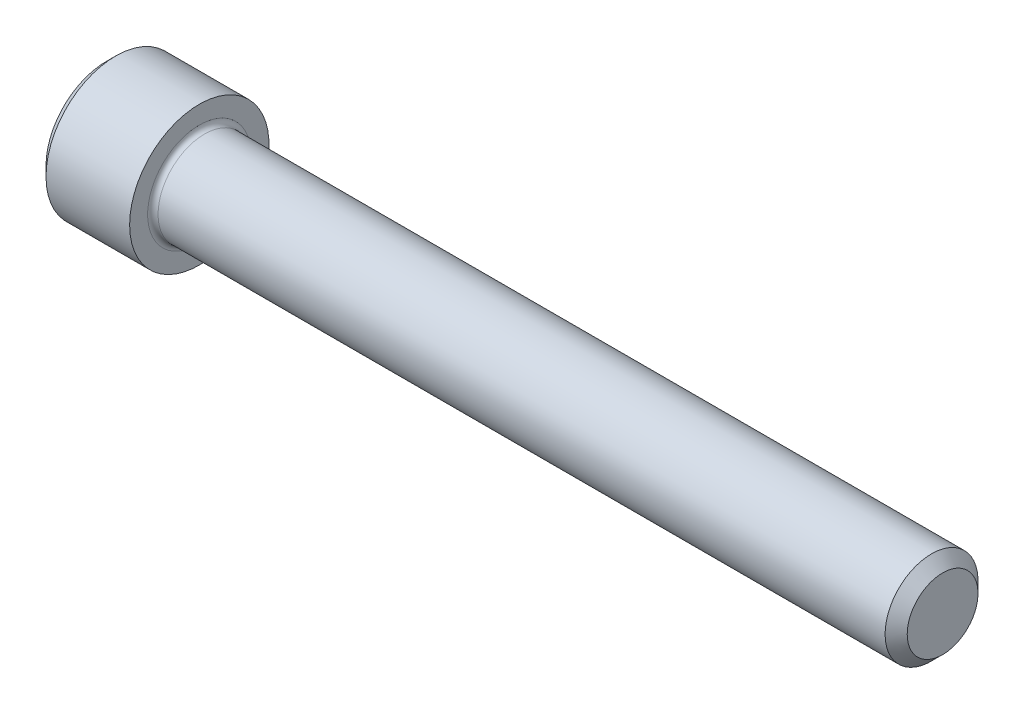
from build123d import *

# Parameters (mm, degrees)
FILLET1_R   = 0.3556
HEX_2_DEPTH = 3.048


with BuildPart() as part:
    # BodySke → Base-Revolve (revolve)
    with BuildSketch(Plane.XY, mode=Mode.PRIVATE) as base_revolve_sk:
        Polygon((0, 0), (0, 4.1275), (0.635, 4.7625), (6.35, 4.7625), (6.35, 3.175), (56.39435, 3.175), (57.15, 2.41935), (57.15, 0), align=None)
    revolve(base_revolve_sk.sketch.rotate(Axis((-31.75, 0, 0), (1, 0, 0)), 90), axis=Axis((-31.75, 0, 0), (1, 0, 0)))

    # Fillet1
    fillet1_edges = [part.edges().sort_by_distance(p)[0] for p in [
        (6.35, 0, -3.175),
    ]]
    fillet(fillet1_edges, radius=FILLET1_R)

    # Sketch2 → Hex-PreBroach (revolve, cut)
    with BuildSketch(Plane.XY, mode=Mode.PRIVATE) as hex_prebroach_sk:
        Polygon((0, 2.38125), (3.048, 2.38125), (4.422815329, 0), (0, 0), align=None)
    revolve(hex_prebroach_sk.sketch.rotate(Axis((0, 0, 0), (1, 0, 0)), 90), axis=Axis((0, 0, 0), (1, 0, 0)), mode=Mode.SUBTRACT)

    # Sketch3 → Hex 2 (cut)
    with BuildSketch(Plane(origin=(0, 0, 0), x_dir=(0, 0.500000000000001, 0.866025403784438), z_dir=(-1, 0, 0))):
        Polygon((1.374815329, 2.38125), (-1.374815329, 2.38125), (-2.749630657, 0), (-1.374815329, -2.38125), (1.374815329, -2.38125), (2.749630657, 0), align=None)
    extrude(amount=-HEX_2_DEPTH, mode=Mode.SUBTRACT)


solid = part.part
